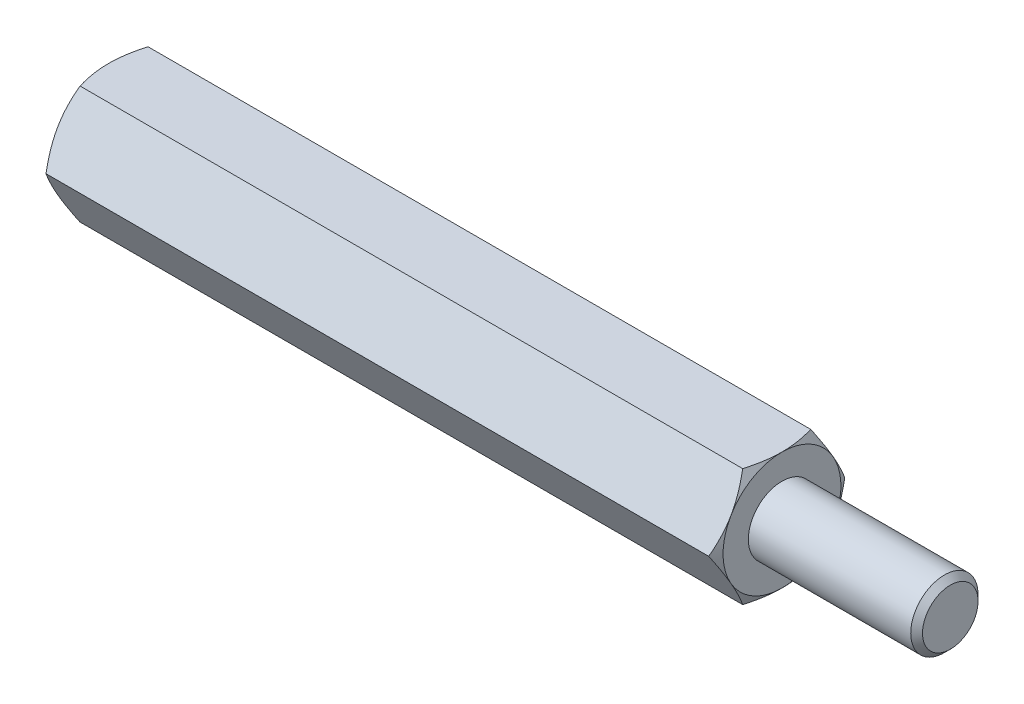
from build123d import *

# Parameters (mm, degrees)
EXTRUDE2_DEPTH = 20
SKETCH3_R      = 1.65
EXTRUDE3_DEPTH = 10
SKETCH5_R      = 2
EXTRUDE4_DEPTH = 10
CHAMFER1_SIZE  = 0.35


with BuildPart() as part:
    # Sketch1 → Extrude2 (new, symmetric)
    with BuildSketch(Plane(origin=(0, 0, 0), x_dir=(0, 0, -1), z_dir=(1, 0, 0))):
        Polygon((2.020725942, 3.5), (-2.020725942, 3.5), (-4.041451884, 0), (-2.020725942, -3.5), (2.020725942, -3.5), (4.041451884, 0), align=None)
    extrude(amount=EXTRUDE2_DEPTH, both=True)

    # Sketch2 → Cut-Revolve1 (revolve, cut)
    with BuildSketch(Plane.XY):
        with BuildLine():
            Line((-20, 3.5), (-18.5, 6.098076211))
            ThreePointArc((-18.5, 6.098076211), (-18.98810136, 7.276457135), (-20, 6.5))
            Line((-20, 6.5), (-20, 3.5))
        make_face()
    cut_revolve1 = revolve(axis=Axis((0, 0, 0), (1, 0, 0)), mode=Mode.SUBTRACT)

    # Mirror1: Cut-Revolve1 across plane
    add(cut_revolve1.mirror(Plane(origin=(0, 0, 0), x_dir=(0, 0, 1), z_dir=(1, 0, 0))), mode=Mode.SUBTRACT)

    # Sketch3 → Extrude3 (cut)
    with BuildSketch(Plane.ZY.offset(20)):
        Circle(SKETCH3_R)
    extrude(amount=-EXTRUDE3_DEPTH, mode=Mode.SUBTRACT)

    # Sketch4 → Cut-Revolve2 (revolve, cut)
    with BuildSketch(Plane.XY, mode=Mode.PRIVATE) as cut_revolve2_sk:
        Polygon((-10, 0), (-10, 1.65), (-9.047372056, 0), align=None)
    revolve(cut_revolve2_sk.sketch.rotate(Axis((-9.047372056, 0, 0), (-1, 0, 0)), 270), axis=Axis((-9.047372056, 0, 0), (-1, 0, 0)), mode=Mode.SUBTRACT)

    # Sketch5 → Extrude4 (add)
    with BuildSketch(Plane(origin=(20, 0, 0), x_dir=(0, 0, -1), z_dir=(1, 0, 0))):
        Circle(SKETCH5_R)
    extrude(amount=EXTRUDE4_DEPTH)

    # Chamfer1
    chamfer1_edges = [part.edges().sort_by_distance(p)[0] for p in [
        (30, 0, 2),
    ]]
    chamfer(chamfer1_edges, length=CHAMFER1_SIZE)


solid = part.part
